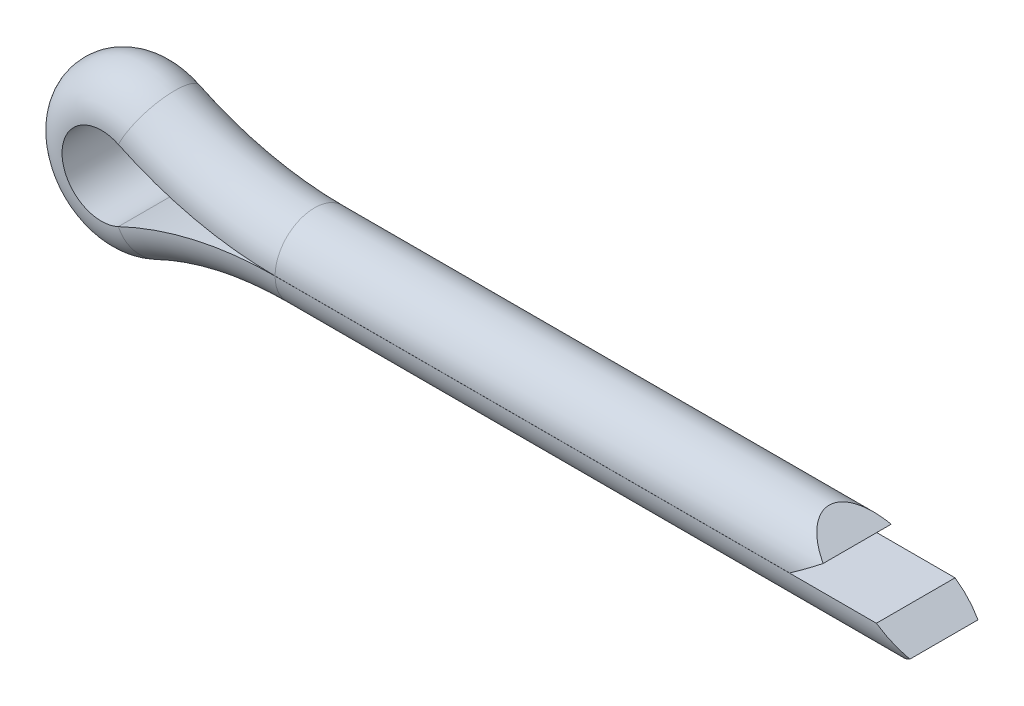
ISO-10303-21;
HEADER;
FILE_DESCRIPTION(('STEP AP214'),'2;1');
FILE_NAME('part.step','',(''),(''),'','','');
FILE_SCHEMA(('AUTOMOTIVE_DESIGN { 1 0 10303 214 1 1 1 1 }'));
ENDSEC;
DATA;
#1=APPLICATION_CONTEXT('core data for automotive mechanical design processes');
#2=APPLICATION_PROTOCOL_DEFINITION('international standard','automotive_design',2000,#1);
#3=PRODUCT_CONTEXT('',#1,'mechanical');
#4=PRODUCT('Part','Part','',(#3));
#5=PRODUCT_RELATED_PRODUCT_CATEGORY('part','',(#4));
#6=PRODUCT_DEFINITION_FORMATION('','',#4);
#7=PRODUCT_DEFINITION_CONTEXT('part definition',#1,'design');
#8=PRODUCT_DEFINITION('design','',#6,#7);
#9=PRODUCT_DEFINITION_SHAPE('','',#8);
#10=(LENGTH_UNIT() NAMED_UNIT(*) SI_UNIT(.MILLI.,.METRE.));
#11=(NAMED_UNIT(*) PLANE_ANGLE_UNIT() SI_UNIT($,.RADIAN.));
#12=(NAMED_UNIT(*) SI_UNIT($,.STERADIAN.) SOLID_ANGLE_UNIT());
#13=UNCERTAINTY_MEASURE_WITH_UNIT(LENGTH_MEASURE(1.E-05),#10,'distance_accuracy_value','');
#14=(GEOMETRIC_REPRESENTATION_CONTEXT(3) GLOBAL_UNCERTAINTY_ASSIGNED_CONTEXT((#13)) GLOBAL_UNIT_ASSIGNED_CONTEXT((#10,
#11,#12)) REPRESENTATION_CONTEXT('',''));
#15=CARTESIAN_POINT('',(0.,0.,0.));
#16=DIRECTION('',(0.,0.,1.));
#17=DIRECTION('',(1.,0.,0.));
#18=AXIS2_PLACEMENT_3D('',#15,#16,#17);
#19=CARTESIAN_POINT('',(6.40000000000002,-0.0019999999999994,1.449998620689));
#20=DIRECTION('',(0.,-1.,0.));
#21=DIRECTION('',(1.,0.,0.));
#22=AXIS2_PLACEMENT_3D('',#19,#20,#21);
#23=PLANE('',#22);
#24=DIRECTION('',(1.,0.,0.));
#25=VECTOR('',#24,1.);
#26=CARTESIAN_POINT('',(6.40000000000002,-0.0019999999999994,1.449998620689));
#27=LINE('',#26,#25);
#28=CARTESIAN_POINT('',(6.40000000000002,-0.0019999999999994,1.449998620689));
#29=VERTEX_POINT('',#28);
#30=CARTESIAN_POINT('',(28.5603342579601,-0.00199999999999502,1.449998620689));
#31=VERTEX_POINT('',#30);
#32=EDGE_CURVE('E40',#29,#31,#27,.T.);
#33=ORIENTED_EDGE('',*,*,#32,.T.);
#34=DIRECTION('',(0.,0.,-1.));
#35=VECTOR('',#34,1.);
#36=CARTESIAN_POINT('',(28.5603342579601,-0.00199999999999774,1.449998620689));
#37=LINE('',#36,#35);
#38=CARTESIAN_POINT('',(28.5603342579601,-0.00199999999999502,-1.449998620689));
#39=VERTEX_POINT('',#38);
#40=EDGE_CURVE('E96',#31,#39,#37,.T.);
#41=ORIENTED_EDGE('',*,*,#40,.T.);
#42=DIRECTION('',(1.,0.,0.));
#43=VECTOR('',#42,1.);
#44=CARTESIAN_POINT('',(6.40000000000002,-0.0019999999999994,-1.449998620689));
#45=LINE('',#44,#43);
#46=CARTESIAN_POINT('',(6.40000000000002,-0.0019999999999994,-1.449998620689));
#47=VERTEX_POINT('',#46);
#48=EDGE_CURVE('E11',#47,#39,#45,.T.);
#49=ORIENTED_EDGE('',*,*,#48,.F.);
#50=DIRECTION('',(0.,0.,-1.));
#51=VECTOR('',#50,1.);
#52=CARTESIAN_POINT('',(6.40000000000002,-0.0019999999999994,1.449998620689));
#53=LINE('',#52,#51);
#54=EDGE_CURVE('E113',#29,#47,#53,.T.);
#55=ORIENTED_EDGE('',*,*,#54,.F.);
#56=EDGE_LOOP('',(#33,#41,#49,#55));
#57=FACE_BOUND('',#56,.T.);
#58=ADVANCED_FACE('F33',(#57),#23,.F.);
#59=CARTESIAN_POINT('',(6.40000000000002,0.,0.));
#60=DIRECTION('',(1.,0.,0.));
#61=DIRECTION('',(0.,1.,0.));
#62=AXIS2_PLACEMENT_3D('',#59,#60,#61);
#63=CYLINDRICAL_SURFACE('',#62,1.45);
#64=CARTESIAN_POINT('',(30.6311749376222,0.,0.));
#65=DIRECTION('',(-0.575683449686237,0.817672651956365,0.));
#66=DIRECTION('',(0.817672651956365,0.575683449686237,0.));
#67=AXIS2_PLACEMENT_3D('',#64,#65,#66);
#68=ELLIPSE('',#67,2.51874532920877,1.45);
#69=CARTESIAN_POINT('',(29.6,-0.725999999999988,-1.25515895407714));
#70=VERTEX_POINT('',#69);
#71=CARTESIAN_POINT('',(29.6,-0.725999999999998,1.25515895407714));
#72=VERTEX_POINT('',#71);
#73=EDGE_CURVE('E110',#70,#72,#68,.T.);
#74=ORIENTED_EDGE('',*,*,#73,.T.);
#75=CARTESIAN_POINT('',(28.5574622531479,0.,0.));
#76=DIRECTION('',(-0.571465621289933,-0.820626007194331,0.));
#77=DIRECTION('',(0.820626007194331,-0.571465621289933,0.));
#78=AXIS2_PLACEMENT_3D('',#75,#76,#77);
#79=ELLIPSE('',#78,2.53733548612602,1.45);
#80=EDGE_CURVE('E99',#72,#31,#79,.T.);
#81=ORIENTED_EDGE('',*,*,#80,.T.);
#82=ORIENTED_EDGE('',*,*,#32,.F.);
#83=CARTESIAN_POINT('',(6.40000000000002,0.,0.));
#84=DIRECTION('',(-1.,0.,0.));
#85=DIRECTION('',(0.,0.,-1.));
#86=AXIS2_PLACEMENT_3D('',#83,#84,#85);
#87=CIRCLE('',#86,1.45);
#88=EDGE_CURVE('E123',#47,#29,#87,.T.);
#89=ORIENTED_EDGE('',*,*,#88,.F.);
#90=ORIENTED_EDGE('',*,*,#48,.T.);
#91=EDGE_CURVE('E101',#39,#70,#79,.T.);
#92=ORIENTED_EDGE('',*,*,#91,.T.);
#93=EDGE_LOOP('',(#74,#81,#82,#89,#90,#92));
#94=FACE_BOUND('',#93,.T.);
#95=ADVANCED_FACE('F107',(#94),#63,.T.);
#96=CARTESIAN_POINT('',(6.4,-13.3991379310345,0.));
#97=DIRECTION('',(0.,0.,-1.));
#98=DIRECTION('',(-1.,0.,0.));
#99=AXIS2_PLACEMENT_3D('',#96,#97,#98);
#100=CYLINDRICAL_SURFACE('',#99,13.3971379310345);
#101=DIRECTION('',(0.,0.,-1.));
#102=VECTOR('',#101,1.);
#103=CARTESIAN_POINT('',(0.625814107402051,-1.31021399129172,1.449998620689));
#104=LINE('',#103,#102);
#105=CARTESIAN_POINT('',(0.625814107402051,-1.31021399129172,1.449998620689));
#106=VERTEX_POINT('',#105);
#107=CARTESIAN_POINT('',(0.625814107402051,-1.31021399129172,-1.449998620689));
#108=VERTEX_POINT('',#107);
#109=EDGE_CURVE('E131',#106,#108,#104,.T.);
#110=ORIENTED_EDGE('',*,*,#109,.F.);
#111=CARTESIAN_POINT('',(6.4,-13.3991379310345,1.449998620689));
#112=DIRECTION('',(0.,0.,-1.));
#113=DIRECTION('',(-1.,0.,0.));
#114=AXIS2_PLACEMENT_3D('',#111,#112,#113);
#115=CIRCLE('',#114,13.3971379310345);
#116=EDGE_CURVE('E117',#106,#29,#115,.T.);
#117=ORIENTED_EDGE('',*,*,#116,.T.);
#118=ORIENTED_EDGE('',*,*,#54,.T.);
#119=CARTESIAN_POINT('',(6.4,-13.3991379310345,-1.449998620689));
#120=DIRECTION('',(0.,0.,-1.));
#121=DIRECTION('',(-1.,0.,0.));
#122=AXIS2_PLACEMENT_3D('',#119,#120,#121);
#123=CIRCLE('',#122,13.3971379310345);
#124=EDGE_CURVE('E115',#108,#47,#123,.T.);
#125=ORIENTED_EDGE('',*,*,#124,.F.);
#126=EDGE_LOOP('',(#110,#117,#118,#125));
#127=FACE_BOUND('',#126,.T.);
#128=ADVANCED_FACE('F175',(#127),#100,.T.);
#129=CARTESIAN_POINT('',(6.4,-13.3991379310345,0.));
#130=DIRECTION('',(0.,0.,-1.));
#131=DIRECTION('',(-1.,0.,0.));
#132=AXIS2_PLACEMENT_3D('',#129,#130,#131);
#133=TOROIDAL_SURFACE('',#132,13.3991379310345,1.45);
#134=CARTESIAN_POINT('',(0.624952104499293,-1.30840928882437,0.));
#135=DIRECTION('',(-0.902351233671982,-0.431001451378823,0.));
#136=DIRECTION('',(0.,0.,-1.));
#137=AXIS2_PLACEMENT_3D('',#134,#135,#136);
#138=CIRCLE('',#137,1.45);
#139=EDGE_CURVE('E134',#108,#106,#138,.T.);
#140=ORIENTED_EDGE('',*,*,#139,.F.);
#141=ORIENTED_EDGE('',*,*,#124,.T.);
#142=ORIENTED_EDGE('',*,*,#88,.T.);
#143=ORIENTED_EDGE('',*,*,#116,.F.);
#144=EDGE_LOOP('',(#140,#141,#142,#143));
#145=FACE_BOUND('',#144,.T.);
#146=ADVANCED_FACE('F177',(#145),#133,.T.);
#147=CARTESIAN_POINT('',(0.,0.,0.));
#148=DIRECTION('',(0.,0.,1.));
#149=DIRECTION('',(1.,0.,0.));
#150=AXIS2_PLACEMENT_3D('',#147,#148,#149);
#151=CYLINDRICAL_SURFACE('',#150,1.452);
#152=DIRECTION('',(0.,0.,-1.));
#153=VECTOR('',#152,1.);
#154=CARTESIAN_POINT('',(0.625814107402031,1.31021399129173,1.449998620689));
#155=LINE('',#154,#153);
#156=CARTESIAN_POINT('',(0.625814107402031,1.31021399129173,1.449998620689));
#157=VERTEX_POINT('',#156);
#158=CARTESIAN_POINT('',(0.625814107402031,1.31021399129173,-1.449998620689));
#159=VERTEX_POINT('',#158);
#160=EDGE_CURVE('E143',#157,#159,#155,.T.);
#161=ORIENTED_EDGE('',*,*,#160,.F.);
#162=CARTESIAN_POINT('',(0.,0.,1.449998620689));
#163=DIRECTION('',(0.,0.,1.));
#164=DIRECTION('',(1.,0.,0.));
#165=AXIS2_PLACEMENT_3D('',#162,#163,#164);
#166=CIRCLE('',#165,1.452);
#167=EDGE_CURVE('E128',#157,#106,#166,.T.);
#168=ORIENTED_EDGE('',*,*,#167,.T.);
#169=ORIENTED_EDGE('',*,*,#109,.T.);
#170=CARTESIAN_POINT('',(0.,0.,-1.449998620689));
#171=DIRECTION('',(0.,0.,1.));
#172=DIRECTION('',(1.,0.,0.));
#173=AXIS2_PLACEMENT_3D('',#170,#171,#172);
#174=CIRCLE('',#173,1.452);
#175=EDGE_CURVE('E125',#159,#108,#174,.T.);
#176=ORIENTED_EDGE('',*,*,#175,.F.);
#177=EDGE_LOOP('',(#161,#168,#169,#176));
#178=FACE_BOUND('',#177,.T.);
#179=ADVANCED_FACE('F181',(#178),#151,.F.);
#180=CARTESIAN_POINT('',(0.,0.,0.));
#181=DIRECTION('',(0.,0.,1.));
#182=DIRECTION('',(1.,0.,0.));
#183=AXIS2_PLACEMENT_3D('',#180,#181,#182);
#184=DEGENERATE_TOROIDAL_SURFACE('',#183,1.45,1.45,.T.);
#185=CARTESIAN_POINT('',(0.624952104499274,1.30840928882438,0.));
#186=DIRECTION('',(0.902351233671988,-0.43100145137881,0.));
#187=DIRECTION('',(0.,0.,-1.));
#188=AXIS2_PLACEMENT_3D('',#185,#186,#187);
#189=CIRCLE('',#188,1.45);
#190=EDGE_CURVE('E146',#159,#157,#189,.T.);
#191=ORIENTED_EDGE('',*,*,#190,.F.);
#192=ORIENTED_EDGE('',*,*,#175,.T.);
#193=ORIENTED_EDGE('',*,*,#139,.T.);
#194=ORIENTED_EDGE('',*,*,#167,.F.);
#195=EDGE_LOOP('',(#191,#192,#193,#194));
#196=FACE_BOUND('',#195,.T.);
#197=ADVANCED_FACE('F183',(#196),#184,.T.);
#198=CARTESIAN_POINT('',(6.4,13.3991379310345,0.));
#199=DIRECTION('',(0.,0.,-1.));
#200=DIRECTION('',(-1.,0.,0.));
#201=AXIS2_PLACEMENT_3D('',#198,#199,#200);
#202=CYLINDRICAL_SURFACE('',#201,13.3971379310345);
#203=DIRECTION('',(0.,0.,-1.));
#204=VECTOR('',#203,1.);
#205=CARTESIAN_POINT('',(6.4,0.00200000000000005,1.449998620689));
#206=LINE('',#205,#204);
#207=CARTESIAN_POINT('',(6.4,0.00200000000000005,1.449998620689));
#208=VERTEX_POINT('',#207);
#209=CARTESIAN_POINT('',(6.4,0.00200000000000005,-1.449998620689));
#210=VERTEX_POINT('',#209);
#211=EDGE_CURVE('E153',#208,#210,#206,.T.);
#212=ORIENTED_EDGE('',*,*,#211,.F.);
#213=CARTESIAN_POINT('',(6.4,13.3991379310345,1.449998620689));
#214=DIRECTION('',(0.,0.,-1.));
#215=DIRECTION('',(-1.,0.,0.));
#216=AXIS2_PLACEMENT_3D('',#213,#214,#215);
#217=CIRCLE('',#216,13.3971379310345);
#218=EDGE_CURVE('E140',#208,#157,#217,.T.);
#219=ORIENTED_EDGE('',*,*,#218,.T.);
#220=ORIENTED_EDGE('',*,*,#160,.T.);
#221=CARTESIAN_POINT('',(6.4,13.3991379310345,-1.449998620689));
#222=DIRECTION('',(0.,0.,-1.));
#223=DIRECTION('',(-1.,0.,0.));
#224=AXIS2_PLACEMENT_3D('',#221,#222,#223);
#225=CIRCLE('',#224,13.3971379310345);
#226=EDGE_CURVE('E137',#210,#159,#225,.T.);
#227=ORIENTED_EDGE('',*,*,#226,.F.);
#228=EDGE_LOOP('',(#212,#219,#220,#227));
#229=FACE_BOUND('',#228,.T.);
#230=ADVANCED_FACE('F187',(#229),#202,.T.);
#231=CARTESIAN_POINT('',(6.4,13.3991379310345,0.));
#232=DIRECTION('',(0.,0.,-1.));
#233=DIRECTION('',(-1.,0.,0.));
#234=AXIS2_PLACEMENT_3D('',#231,#232,#233);
#235=TOROIDAL_SURFACE('',#234,13.3991379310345,1.45);
#236=CARTESIAN_POINT('',(6.4,0.,0.));
#237=DIRECTION('',(1.,0.,0.));
#238=DIRECTION('',(0.,0.,-1.));
#239=AXIS2_PLACEMENT_3D('',#236,#237,#238);
#240=CIRCLE('',#239,1.45);
#241=EDGE_CURVE('E158',#210,#208,#240,.T.);
#242=ORIENTED_EDGE('',*,*,#241,.F.);
#243=ORIENTED_EDGE('',*,*,#226,.T.);
#244=ORIENTED_EDGE('',*,*,#190,.T.);
#245=ORIENTED_EDGE('',*,*,#218,.F.);
#246=EDGE_LOOP('',(#242,#243,#244,#245));
#247=FACE_BOUND('',#246,.T.);
#248=ADVANCED_FACE('F189',(#247),#235,.T.);
#249=CARTESIAN_POINT('',(6.4,0.,0.));
#250=DIRECTION('',(1.,0.,0.));
#251=DIRECTION('',(0.,0.,-1.));
#252=AXIS2_PLACEMENT_3D('',#249,#250,#251);
#253=CYLINDRICAL_SURFACE('',#252,1.45);
#254=CARTESIAN_POINT('',(25.3574622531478,0.,0.));
#255=DIRECTION('',(-0.571465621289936,0.820626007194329,0.));
#256=DIRECTION('',(0.820626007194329,0.571465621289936,0.));
#257=AXIS2_PLACEMENT_3D('',#254,#255,#256);
#258=ELLIPSE('',#257,2.53733548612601,1.45);
#259=CARTESIAN_POINT('',(26.4,0.726,1.25515895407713));
#260=VERTEX_POINT('',#259);
#261=CARTESIAN_POINT('',(25.3603342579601,0.00200000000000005,1.449998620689));
#262=VERTEX_POINT('',#261);
#263=EDGE_CURVE('E47',#260,#262,#258,.F.);
#264=ORIENTED_EDGE('',*,*,#263,.F.);
#265=CARTESIAN_POINT('',(27.4311749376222,0.,0.));
#266=DIRECTION('',(-0.575683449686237,-0.817672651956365,0.));
#267=DIRECTION('',(0.817672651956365,-0.575683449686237,0.));
#268=AXIS2_PLACEMENT_3D('',#265,#266,#267);
#269=ELLIPSE('',#268,2.51874532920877,1.45);
#270=CARTESIAN_POINT('',(26.4,0.726,-1.25515895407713));
#271=VERTEX_POINT('',#270);
#272=EDGE_CURVE('E162',#271,#260,#269,.F.);
#273=ORIENTED_EDGE('',*,*,#272,.F.);
#274=CARTESIAN_POINT('',(25.3603342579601,0.00199999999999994,-1.449998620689));
#275=VERTEX_POINT('',#274);
#276=EDGE_CURVE('E164',#275,#271,#258,.F.);
#277=ORIENTED_EDGE('',*,*,#276,.F.);
#278=DIRECTION('',(1.,0.,0.));
#279=VECTOR('',#278,1.);
#280=CARTESIAN_POINT('',(6.4,0.00200000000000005,-1.449998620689));
#281=LINE('',#280,#279);
#282=EDGE_CURVE('E149',#210,#275,#281,.T.);
#283=ORIENTED_EDGE('',*,*,#282,.F.);
#284=ORIENTED_EDGE('',*,*,#241,.T.);
#285=DIRECTION('',(1.,0.,0.));
#286=VECTOR('',#285,1.);
#287=CARTESIAN_POINT('',(6.4,0.00200000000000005,1.449998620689));
#288=LINE('',#287,#286);
#289=EDGE_CURVE('E150',#208,#262,#288,.T.);
#290=ORIENTED_EDGE('',*,*,#289,.T.);
#291=EDGE_LOOP('',(#264,#273,#277,#283,#284,#290));
#292=FACE_BOUND('',#291,.T.);
#293=ADVANCED_FACE('F193',(#292),#253,.T.);
#294=CARTESIAN_POINT('',(6.4,0.00200000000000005,1.449998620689));
#295=DIRECTION('',(0.,-1.,0.));
#296=DIRECTION('',(0.,0.,-1.));
#297=AXIS2_PLACEMENT_3D('',#294,#295,#296);
#298=PLANE('',#297);
#299=DIRECTION('',(0.,0.,-1.));
#300=VECTOR('',#299,1.);
#301=CARTESIAN_POINT('',(25.3603342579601,0.00200000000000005,1.449998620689));
#302=LINE('',#301,#300);
#303=EDGE_CURVE('E166',#262,#275,#302,.T.);
#304=ORIENTED_EDGE('',*,*,#303,.F.);
#305=ORIENTED_EDGE('',*,*,#289,.F.);
#306=ORIENTED_EDGE('',*,*,#211,.T.);
#307=ORIENTED_EDGE('',*,*,#282,.T.);
#308=EDGE_LOOP('',(#304,#305,#306,#307));
#309=FACE_BOUND('',#308,.T.);
#310=ADVANCED_FACE('F197',(#309),#298,.T.);
#311=CARTESIAN_POINT('',(26.4,0.726,-1.449998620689));
#312=DIRECTION('',(-0.571465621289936,0.820626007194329,0.));
#313=DIRECTION('',(-0.820626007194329,-0.571465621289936,0.));
#314=AXIS2_PLACEMENT_3D('',#311,#312,#313);
#315=PLANE('',#314);
#316=ORIENTED_EDGE('',*,*,#263,.T.);
#317=ORIENTED_EDGE('',*,*,#303,.T.);
#318=ORIENTED_EDGE('',*,*,#276,.T.);
#319=DIRECTION('',(0.,0.,1.));
#320=VECTOR('',#319,1.);
#321=CARTESIAN_POINT('',(26.4,0.726,-1.449998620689));
#322=LINE('',#321,#320);
#323=EDGE_CURVE('E168',#271,#260,#322,.T.);
#324=ORIENTED_EDGE('',*,*,#323,.T.);
#325=EDGE_LOOP('',(#316,#317,#318,#324));
#326=FACE_BOUND('',#325,.T.);
#327=ADVANCED_FACE('F201',(#326),#315,.F.);
#328=CARTESIAN_POINT('',(25.3574622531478,1.46,-1.449998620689));
#329=DIRECTION('',(-0.575683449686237,-0.817672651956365,0.));
#330=DIRECTION('',(0.817672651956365,-0.575683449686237,0.));
#331=AXIS2_PLACEMENT_3D('',#328,#329,#330);
#332=PLANE('',#331);
#333=ORIENTED_EDGE('',*,*,#272,.T.);
#334=ORIENTED_EDGE('',*,*,#323,.F.);
#335=EDGE_LOOP('',(#333,#334));
#336=FACE_BOUND('',#335,.T.);
#337=ADVANCED_FACE('F200',(#336),#332,.F.);
#338=CARTESIAN_POINT('',(29.6,-0.725999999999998,-1.449998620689));
#339=DIRECTION('',(-0.575683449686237,0.817672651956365,0.));
#340=DIRECTION('',(-0.817672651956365,-0.575683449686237,0.));
#341=AXIS2_PLACEMENT_3D('',#338,#339,#340);
#342=PLANE('',#341);
#343=DIRECTION('',(0.,0.,1.));
#344=VECTOR('',#343,1.);
#345=CARTESIAN_POINT('',(29.6,-0.725999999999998,-1.449998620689));
#346=LINE('',#345,#344);
#347=EDGE_CURVE('E55',#70,#72,#346,.T.);
#348=ORIENTED_EDGE('',*,*,#347,.T.);
#349=ORIENTED_EDGE('',*,*,#73,.F.);
#350=EDGE_LOOP('',(#348,#349));
#351=FACE_BOUND('',#350,.T.);
#352=ADVANCED_FACE('F171',(#351),#342,.F.);
#353=CARTESIAN_POINT('',(28.5574622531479,0.,-1.449998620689));
#354=DIRECTION('',(-0.571465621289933,-0.820626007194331,0.));
#355=DIRECTION('',(0.820626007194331,-0.571465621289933,0.));
#356=AXIS2_PLACEMENT_3D('',#353,#354,#355);
#357=PLANE('',#356);
#358=ORIENTED_EDGE('',*,*,#347,.F.);
#359=ORIENTED_EDGE('',*,*,#91,.F.);
#360=ORIENTED_EDGE('',*,*,#40,.F.);
#361=ORIENTED_EDGE('',*,*,#80,.F.);
#362=EDGE_LOOP('',(#358,#359,#360,#361));
#363=FACE_BOUND('',#362,.T.);
#364=ADVANCED_FACE('F98',(#363),#357,.F.);
#365=CLOSED_SHELL('',(#58,#95,#128,#146,#179,#197,#230,#248,#293,#310,#327,#337,#352,#364));
#366=MANIFOLD_SOLID_BREP('B2',#365);
#367=ADVANCED_BREP_SHAPE_REPRESENTATION('',(#18,#366),#14);
#368=SHAPE_DEFINITION_REPRESENTATION(#9,#367);
ENDSEC;
END-ISO-10303-21;
